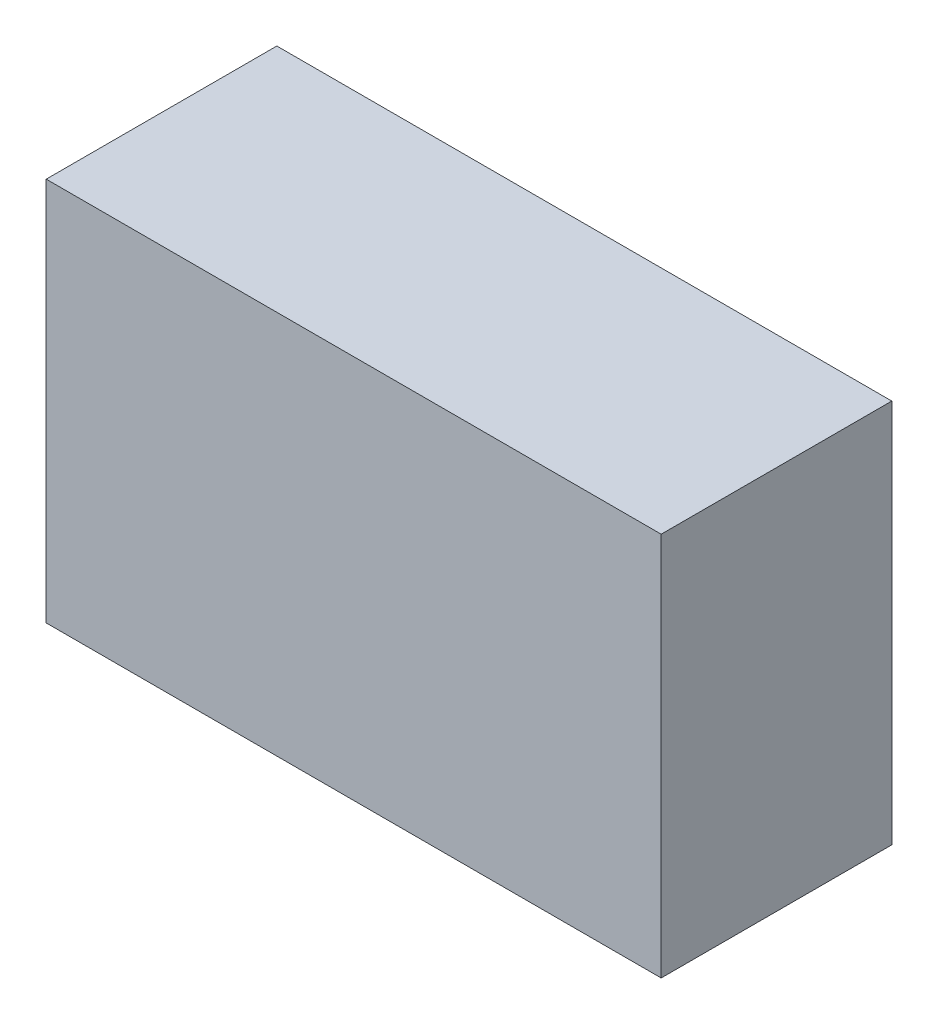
ISO-10303-21;
HEADER;
FILE_DESCRIPTION(('STEP AP214'),'2;1');
FILE_NAME('part.step','',(''),(''),'','','');
FILE_SCHEMA(('AUTOMOTIVE_DESIGN { 1 0 10303 214 1 1 1 1 }'));
ENDSEC;
DATA;
#1=APPLICATION_CONTEXT('core data for automotive mechanical design processes');
#2=APPLICATION_PROTOCOL_DEFINITION('international standard','automotive_design',2000,#1);
#3=PRODUCT_CONTEXT('',#1,'mechanical');
#4=PRODUCT('Part','Part','',(#3));
#5=PRODUCT_RELATED_PRODUCT_CATEGORY('part','',(#4));
#6=PRODUCT_DEFINITION_FORMATION('','',#4);
#7=PRODUCT_DEFINITION_CONTEXT('part definition',#1,'design');
#8=PRODUCT_DEFINITION('design','',#6,#7);
#9=PRODUCT_DEFINITION_SHAPE('','',#8);
#10=(LENGTH_UNIT() NAMED_UNIT(*) SI_UNIT(.MILLI.,.METRE.));
#11=(NAMED_UNIT(*) PLANE_ANGLE_UNIT() SI_UNIT($,.RADIAN.));
#12=(NAMED_UNIT(*) SI_UNIT($,.STERADIAN.) SOLID_ANGLE_UNIT());
#13=UNCERTAINTY_MEASURE_WITH_UNIT(LENGTH_MEASURE(1.E-05),#10,'distance_accuracy_value','');
#14=(GEOMETRIC_REPRESENTATION_CONTEXT(3) GLOBAL_UNCERTAINTY_ASSIGNED_CONTEXT((#13)) GLOBAL_UNIT_ASSIGNED_CONTEXT((#10,
#11,#12)) REPRESENTATION_CONTEXT('',''));
#15=CARTESIAN_POINT('',(0.,0.,0.));
#16=DIRECTION('',(0.,0.,1.));
#17=DIRECTION('',(1.,0.,0.));
#18=AXIS2_PLACEMENT_3D('',#15,#16,#17);
#19=CARTESIAN_POINT('',(0.,0.,30.));
#20=DIRECTION('',(1.,0.,0.));
#21=DIRECTION('',(0.,0.,-1.));
#22=AXIS2_PLACEMENT_3D('',#19,#20,#21);
#23=PLANE('',#22);
#24=DIRECTION('',(0.,-1.,0.));
#25=VECTOR('',#24,1.);
#26=CARTESIAN_POINT('',(0.,0.,0.));
#27=LINE('',#26,#25);
#28=CARTESIAN_POINT('',(0.,50.,0.));
#29=VERTEX_POINT('',#28);
#30=CARTESIAN_POINT('',(0.,0.,0.));
#31=VERTEX_POINT('',#30);
#32=EDGE_CURVE('E95',#29,#31,#27,.T.);
#33=ORIENTED_EDGE('',*,*,#32,.T.);
#34=DIRECTION('',(0.,0.,-1.));
#35=VECTOR('',#34,1.);
#36=CARTESIAN_POINT('',(0.,0.,30.));
#37=LINE('',#36,#35);
#38=CARTESIAN_POINT('',(0.,0.,30.));
#39=VERTEX_POINT('',#38);
#40=EDGE_CURVE('E11',#39,#31,#37,.T.);
#41=ORIENTED_EDGE('',*,*,#40,.F.);
#42=DIRECTION('',(0.,-1.,0.));
#43=VECTOR('',#42,1.);
#44=CARTESIAN_POINT('',(0.,0.,30.));
#45=LINE('',#44,#43);
#46=CARTESIAN_POINT('',(0.,50.,30.));
#47=VERTEX_POINT('',#46);
#48=EDGE_CURVE('E83',#47,#39,#45,.T.);
#49=ORIENTED_EDGE('',*,*,#48,.F.);
#50=DIRECTION('',(0.,0.,-1.));
#51=VECTOR('',#50,1.);
#52=CARTESIAN_POINT('',(0.,50.,30.));
#53=LINE('',#52,#51);
#54=EDGE_CURVE('E91',#47,#29,#53,.T.);
#55=ORIENTED_EDGE('',*,*,#54,.T.);
#56=EDGE_LOOP('',(#33,#41,#49,#55));
#57=FACE_BOUND('',#56,.T.);
#58=ADVANCED_FACE('F32',(#57),#23,.F.);
#59=CARTESIAN_POINT('',(0.,0.,30.));
#60=DIRECTION('',(0.,1.,0.));
#61=DIRECTION('',(0.,0.,1.));
#62=AXIS2_PLACEMENT_3D('',#59,#60,#61);
#63=PLANE('',#62);
#64=DIRECTION('',(1.,0.,0.));
#65=VECTOR('',#64,1.);
#66=CARTESIAN_POINT('',(0.,0.,0.));
#67=LINE('',#66,#65);
#68=CARTESIAN_POINT('',(80.,0.,0.));
#69=VERTEX_POINT('',#68);
#70=EDGE_CURVE('E87',#31,#69,#67,.T.);
#71=ORIENTED_EDGE('',*,*,#70,.T.);
#72=DIRECTION('',(0.,0.,-1.));
#73=VECTOR('',#72,1.);
#74=CARTESIAN_POINT('',(80.,0.,30.));
#75=LINE('',#74,#73);
#76=CARTESIAN_POINT('',(80.,0.,30.));
#77=VERTEX_POINT('',#76);
#78=EDGE_CURVE('E40',#77,#69,#75,.T.);
#79=ORIENTED_EDGE('',*,*,#78,.F.);
#80=DIRECTION('',(1.,0.,0.));
#81=VECTOR('',#80,1.);
#82=CARTESIAN_POINT('',(0.,0.,30.));
#83=LINE('',#82,#81);
#84=EDGE_CURVE('E78',#39,#77,#83,.T.);
#85=ORIENTED_EDGE('',*,*,#84,.F.);
#86=ORIENTED_EDGE('',*,*,#40,.T.);
#87=EDGE_LOOP('',(#71,#79,#85,#86));
#88=FACE_BOUND('',#87,.T.);
#89=ADVANCED_FACE('F86',(#88),#63,.F.);
#90=CARTESIAN_POINT('',(80.,0.,30.));
#91=DIRECTION('',(-1.,0.,0.));
#92=DIRECTION('',(0.,0.,1.));
#93=AXIS2_PLACEMENT_3D('',#90,#91,#92);
#94=PLANE('',#93);
#95=DIRECTION('',(0.,1.,0.));
#96=VECTOR('',#95,1.);
#97=CARTESIAN_POINT('',(80.,0.,0.));
#98=LINE('',#97,#96);
#99=CARTESIAN_POINT('',(80.,50.,0.));
#100=VERTEX_POINT('',#99);
#101=EDGE_CURVE('E65',#69,#100,#98,.T.);
#102=ORIENTED_EDGE('',*,*,#101,.T.);
#103=DIRECTION('',(0.,0.,-1.));
#104=VECTOR('',#103,1.);
#105=CARTESIAN_POINT('',(80.,50.,30.));
#106=LINE('',#105,#104);
#107=CARTESIAN_POINT('',(80.,50.,30.));
#108=VERTEX_POINT('',#107);
#109=EDGE_CURVE('E88',#108,#100,#106,.T.);
#110=ORIENTED_EDGE('',*,*,#109,.F.);
#111=DIRECTION('',(0.,1.,0.));
#112=VECTOR('',#111,1.);
#113=CARTESIAN_POINT('',(80.,0.,30.));
#114=LINE('',#113,#112);
#115=EDGE_CURVE('E81',#77,#108,#114,.T.);
#116=ORIENTED_EDGE('',*,*,#115,.F.);
#117=ORIENTED_EDGE('',*,*,#78,.T.);
#118=EDGE_LOOP('',(#102,#110,#116,#117));
#119=FACE_BOUND('',#118,.T.);
#120=ADVANCED_FACE('F89',(#119),#94,.F.);
#121=CARTESIAN_POINT('',(0.,50.,30.));
#122=DIRECTION('',(0.,-1.,0.));
#123=DIRECTION('',(0.,0.,-1.));
#124=AXIS2_PLACEMENT_3D('',#121,#122,#123);
#125=PLANE('',#124);
#126=DIRECTION('',(-1.,0.,0.));
#127=VECTOR('',#126,1.);
#128=CARTESIAN_POINT('',(0.,50.,0.));
#129=LINE('',#128,#127);
#130=EDGE_CURVE('E71',#100,#29,#129,.T.);
#131=ORIENTED_EDGE('',*,*,#130,.T.);
#132=ORIENTED_EDGE('',*,*,#54,.F.);
#133=DIRECTION('',(-1.,0.,0.));
#134=VECTOR('',#133,1.);
#135=CARTESIAN_POINT('',(0.,50.,30.));
#136=LINE('',#135,#134);
#137=EDGE_CURVE('E48',#108,#47,#136,.T.);
#138=ORIENTED_EDGE('',*,*,#137,.F.);
#139=ORIENTED_EDGE('',*,*,#109,.T.);
#140=EDGE_LOOP('',(#131,#132,#138,#139));
#141=FACE_BOUND('',#140,.T.);
#142=ADVANCED_FACE('F102',(#141),#125,.F.);
#143=CARTESIAN_POINT('',(0.,0.,30.));
#144=DIRECTION('',(0.,0.,-1.));
#145=DIRECTION('',(-1.,0.,0.));
#146=AXIS2_PLACEMENT_3D('',#143,#144,#145);
#147=PLANE('',#146);
#148=ORIENTED_EDGE('',*,*,#48,.T.);
#149=ORIENTED_EDGE('',*,*,#84,.T.);
#150=ORIENTED_EDGE('',*,*,#115,.T.);
#151=ORIENTED_EDGE('',*,*,#137,.T.);
#152=EDGE_LOOP('',(#148,#149,#150,#151));
#153=FACE_BOUND('',#152,.T.);
#154=ADVANCED_FACE('F79',(#153),#147,.F.);
#155=CARTESIAN_POINT('',(0.,0.,0.));
#156=DIRECTION('',(0.,0.,-1.));
#157=DIRECTION('',(-1.,0.,0.));
#158=AXIS2_PLACEMENT_3D('',#155,#156,#157);
#159=PLANE('',#158);
#160=ORIENTED_EDGE('',*,*,#32,.F.);
#161=ORIENTED_EDGE('',*,*,#130,.F.);
#162=ORIENTED_EDGE('',*,*,#101,.F.);
#163=ORIENTED_EDGE('',*,*,#70,.F.);
#164=EDGE_LOOP('',(#160,#161,#162,#163));
#165=FACE_BOUND('',#164,.T.);
#166=ADVANCED_FACE('F105',(#165),#159,.T.);
#167=CLOSED_SHELL('',(#58,#89,#120,#142,#154,#166));
#168=MANIFOLD_SOLID_BREP('B2',#167);
#169=ADVANCED_BREP_SHAPE_REPRESENTATION('',(#18,#168),#14);
#170=SHAPE_DEFINITION_REPRESENTATION(#9,#169);
ENDSEC;
END-ISO-10303-21;
